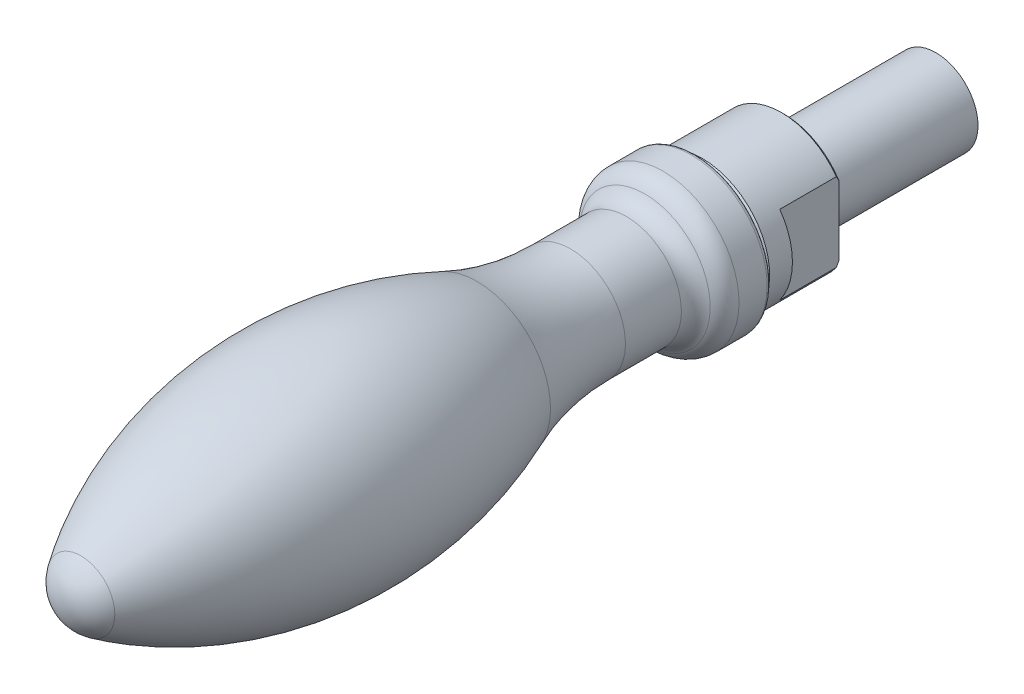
ISO-10303-21;
HEADER;
FILE_DESCRIPTION(('STEP AP214'),'2;1');
FILE_NAME('part.step','',(''),(''),'','','');
FILE_SCHEMA(('AUTOMOTIVE_DESIGN { 1 0 10303 214 1 1 1 1 }'));
ENDSEC;
DATA;
#1=APPLICATION_CONTEXT('core data for automotive mechanical design processes');
#2=APPLICATION_PROTOCOL_DEFINITION('international standard','automotive_design',2000,#1);
#3=PRODUCT_CONTEXT('',#1,'mechanical');
#4=PRODUCT('Part','Part','',(#3));
#5=PRODUCT_RELATED_PRODUCT_CATEGORY('part','',(#4));
#6=PRODUCT_DEFINITION_FORMATION('','',#4);
#7=PRODUCT_DEFINITION_CONTEXT('part definition',#1,'design');
#8=PRODUCT_DEFINITION('design','',#6,#7);
#9=PRODUCT_DEFINITION_SHAPE('','',#8);
#10=(LENGTH_UNIT() NAMED_UNIT(*) SI_UNIT(.MILLI.,.METRE.));
#11=(NAMED_UNIT(*) PLANE_ANGLE_UNIT() SI_UNIT($,.RADIAN.));
#12=(NAMED_UNIT(*) SI_UNIT($,.STERADIAN.) SOLID_ANGLE_UNIT());
#13=UNCERTAINTY_MEASURE_WITH_UNIT(LENGTH_MEASURE(1.E-05),#10,'distance_accuracy_value','');
#14=(GEOMETRIC_REPRESENTATION_CONTEXT(3) GLOBAL_UNCERTAINTY_ASSIGNED_CONTEXT((#13)) GLOBAL_UNIT_ASSIGNED_CONTEXT((#10,
#11,#12)) REPRESENTATION_CONTEXT('',''));
#15=CARTESIAN_POINT('',(0.,0.,0.));
#16=DIRECTION('',(0.,0.,1.));
#17=DIRECTION('',(1.,0.,0.));
#18=AXIS2_PLACEMENT_3D('',#15,#16,#17);
#19=CARTESIAN_POINT('',(0.,0.,-22.9999999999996));
#20=DIRECTION('',(0.,0.,-1.));
#21=DIRECTION('',(0.,1.,0.));
#22=AXIS2_PLACEMENT_3D('',#19,#20,#21);
#23=CYLINDRICAL_SURFACE('',#22,8.);
#24=CARTESIAN_POINT('',(0.,0.,9.7));
#25=DIRECTION('',(0.,0.,-1.));
#26=DIRECTION('',(0.,1.,0.));
#27=AXIS2_PLACEMENT_3D('',#24,#25,#26);
#28=CIRCLE('',#27,8.);
#29=CARTESIAN_POINT('',(0.,8.,9.7));
#30=VERTEX_POINT('',#29);
#31=EDGE_CURVE('E205',#30,#30,#28,.T.);
#32=ORIENTED_EDGE('',*,*,#31,.T.);
#33=EDGE_LOOP('',(#32));
#34=FACE_BOUND('',#33,.T.);
#35=CARTESIAN_POINT('',(0.,0.,0.299999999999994));
#36=DIRECTION('',(0.,0.,-1.));
#37=DIRECTION('',(0.,1.,0.));
#38=AXIS2_PLACEMENT_3D('',#35,#36,#37);
#39=CIRCLE('',#38,8.);
#40=CARTESIAN_POINT('',(-6.5,4.66368952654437,0.299999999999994));
#41=VERTEX_POINT('',#40);
#42=CARTESIAN_POINT('',(6.5,4.66368952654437,0.299999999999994));
#43=VERTEX_POINT('',#42);
#44=EDGE_CURVE('E84',#41,#43,#39,.T.);
#45=ORIENTED_EDGE('',*,*,#44,.F.);
#46=DIRECTION('',(0.,0.,-1.));
#47=VECTOR('',#46,1.);
#48=CARTESIAN_POINT('',(-6.5,4.66368952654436,-22.9999999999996));
#49=LINE('',#48,#47);
#50=CARTESIAN_POINT('',(-6.5,4.66368952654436,6.99999999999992));
#51=VERTEX_POINT('',#50);
#52=EDGE_CURVE('E77',#41,#51,#49,.F.);
#53=ORIENTED_EDGE('',*,*,#52,.T.);
#54=CARTESIAN_POINT('',(0.,0.,6.99999999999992));
#55=DIRECTION('',(0.,0.,1.));
#56=DIRECTION('',(0.,-1.,0.));
#57=AXIS2_PLACEMENT_3D('',#54,#55,#56);
#58=CIRCLE('',#57,8.);
#59=CARTESIAN_POINT('',(-6.5,-4.66368952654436,6.99999999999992));
#60=VERTEX_POINT('',#59);
#61=EDGE_CURVE('E9',#60,#51,#58,.F.);
#62=ORIENTED_EDGE('',*,*,#61,.F.);
#63=DIRECTION('',(0.,0.,-1.));
#64=VECTOR('',#63,1.);
#65=CARTESIAN_POINT('',(-6.5,-4.66368952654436,-22.9999999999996));
#66=LINE('',#65,#64);
#67=CARTESIAN_POINT('',(-6.5,-4.66368952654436,0.299999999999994));
#68=VERTEX_POINT('',#67);
#69=EDGE_CURVE('E66',#60,#68,#66,.T.);
#70=ORIENTED_EDGE('',*,*,#69,.T.);
#71=CARTESIAN_POINT('',(6.5,-4.66368952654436,0.299999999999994));
#72=VERTEX_POINT('',#71);
#73=EDGE_CURVE('E223',#72,#68,#39,.T.);
#74=ORIENTED_EDGE('',*,*,#73,.F.);
#75=DIRECTION('',(0.,0.,-1.));
#76=VECTOR('',#75,1.);
#77=CARTESIAN_POINT('',(6.5,-4.66368952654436,-22.9999999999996));
#78=LINE('',#77,#76);
#79=CARTESIAN_POINT('',(6.5,-4.66368952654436,6.99999999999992));
#80=VERTEX_POINT('',#79);
#81=EDGE_CURVE('E230',#80,#72,#78,.T.);
#82=ORIENTED_EDGE('',*,*,#81,.F.);
#83=CARTESIAN_POINT('',(0.,0.,6.99999999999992));
#84=DIRECTION('',(0.,0.,-1.));
#85=DIRECTION('',(0.,1.,0.));
#86=AXIS2_PLACEMENT_3D('',#83,#84,#85);
#87=CIRCLE('',#86,8.);
#88=CARTESIAN_POINT('',(6.5,4.66368952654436,6.99999999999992));
#89=VERTEX_POINT('',#88);
#90=EDGE_CURVE('E203',#80,#89,#87,.F.);
#91=ORIENTED_EDGE('',*,*,#90,.T.);
#92=DIRECTION('',(0.,0.,-1.));
#93=VECTOR('',#92,1.);
#94=CARTESIAN_POINT('',(6.5,4.66368952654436,-22.9999999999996));
#95=LINE('',#94,#93);
#96=EDGE_CURVE('E227',#43,#89,#95,.F.);
#97=ORIENTED_EDGE('',*,*,#96,.F.);
#98=EDGE_LOOP('',(#45,#53,#62,#70,#74,#82,#91,#97));
#99=FACE_BOUND('',#98,.T.);
#100=ADVANCED_FACE('F14',(#34,#99),#23,.T.);
#101=CARTESIAN_POINT('',(0.,0.,0.));
#102=DIRECTION('',(0.,0.,1.));
#103=DIRECTION('',(0.,-1.,0.));
#104=AXIS2_PLACEMENT_3D('',#101,#102,#103);
#105=CONICAL_SURFACE('',#104,7.7,0.785398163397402);
#106=ORIENTED_EDGE('',*,*,#73,.T.);
#107=CARTESIAN_POINT('',(-6.5,-10.7476397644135,4.86032485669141));
#108=CARTESIAN_POINT('',(-6.5,-10.4743236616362,4.62651096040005));
#109=CARTESIAN_POINT('',(-6.5,-10.1998725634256,4.3940042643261));
#110=CARTESIAN_POINT('',(-6.5,-9.64805570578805,3.93235778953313));
#111=CARTESIAN_POINT('',(-6.5,-9.3706893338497,3.70321874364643));
#112=CARTESIAN_POINT('',(-6.5,-8.81068016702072,3.24766930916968));
#113=CARTESIAN_POINT('',(-6.5,-8.52801467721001,3.02128674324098));
#114=CARTESIAN_POINT('',(-6.5,-7.95840712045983,2.57400091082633));
#115=CARTESIAN_POINT('',(-6.5,-7.67146542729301,2.35309716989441));
#116=CARTESIAN_POINT('',(-6.5,-7.10387135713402,1.9271091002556));
#117=CARTESIAN_POINT('',(-6.5,-6.82342914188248,1.72174573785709));
#118=CARTESIAN_POINT('',(-6.5,-6.25637524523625,1.31954713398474));
#119=CARTESIAN_POINT('',(-6.5,-5.96976238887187,1.12271353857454));
#120=CARTESIAN_POINT('',(-6.5,-5.38951207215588,0.740922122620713));
#121=CARTESIAN_POINT('',(-6.5,-5.09588979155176,0.555941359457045));
#122=CARTESIAN_POINT('',(-6.5,-4.4993473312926,0.201675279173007));
#123=CARTESIAN_POINT('',(-6.5,-4.19643168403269,0.0323824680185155));
#124=CARTESIAN_POINT('',(-6.5,-3.75630978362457,-0.193523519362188));
#125=CARTESIAN_POINT('',(-6.5,-3.62368369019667,-0.259084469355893));
#126=CARTESIAN_POINT('',(-6.5,-3.35624398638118,-0.385598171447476));
#127=CARTESIAN_POINT('',(-6.5,-3.22143042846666,-0.446551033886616));
#128=CARTESIAN_POINT('',(-6.5,-2.94973823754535,-0.563059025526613));
#129=CARTESIAN_POINT('',(-6.5,-2.81286327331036,-0.618622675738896));
#130=CARTESIAN_POINT('',(-6.5,-2.53678404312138,-0.723684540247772));
#131=CARTESIAN_POINT('',(-6.5,-2.39757964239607,-0.773182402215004));
#132=CARTESIAN_POINT('',(-6.5,-2.11465531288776,-0.865994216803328));
#133=CARTESIAN_POINT('',(-6.5,-1.97089877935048,-0.909197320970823));
#134=CARTESIAN_POINT('',(-6.5,-1.68122524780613,-0.987543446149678));
#135=CARTESIAN_POINT('',(-6.5,-1.53530872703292,-1.02268822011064));
#136=CARTESIAN_POINT('',(-6.5,-1.24068347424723,-1.08422588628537));
#137=CARTESIAN_POINT('',(-6.5,-1.09196308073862,-1.11056354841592));
#138=CARTESIAN_POINT('',(-6.5,-0.792996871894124,-1.15349058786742));
#139=CARTESIAN_POINT('',(-6.5,-0.64274984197,-1.17007146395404));
#140=CARTESIAN_POINT('',(-6.5,-0.49206240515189,-1.18140157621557));
#141=B_SPLINE_CURVE_WITH_KNOTS('',3,(#107,#108,#109,#110,#111,#112,#113,#114,#115,#116,#117,
#118,#119,#120,#121,#122,#123,#124,#125,#126,#127,#128,#129,#130,#131,#132,#133,#134,#135,#136,
#137,#138,#139,#140),.UNSPECIFIED.,.F.,.F.,(4,2,2,2,2,2,2,2,2,2,2,2,2,2,2,2,4),(0.,
1.07905876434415,2.15834896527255,3.24473097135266,4.33101856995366,5.37368385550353,
6.4165494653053,7.45733137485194,8.49761351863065,8.94138053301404,9.38513691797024,
9.82817982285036,10.2712484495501,10.7213624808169,11.1713785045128,11.6241658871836,
12.077347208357),.UNSPECIFIED.);
#142=CARTESIAN_POINT('',(-6.5,-4.12795348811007,0.));
#143=VERTEX_POINT('',#142);
#144=EDGE_CURVE('E72',#68,#143,#141,.T.);
#145=ORIENTED_EDGE('',*,*,#144,.T.);
#146=CARTESIAN_POINT('',(0.,0.,0.));
#147=DIRECTION('',(0.,0.,-1.));
#148=DIRECTION('',(0.,1.,0.));
#149=AXIS2_PLACEMENT_3D('',#146,#147,#148);
#150=CIRCLE('',#149,7.7);
#151=CARTESIAN_POINT('',(6.5,-4.12795348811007,0.));
#152=VERTEX_POINT('',#151);
#153=EDGE_CURVE('E214',#152,#143,#150,.T.);
#154=ORIENTED_EDGE('',*,*,#153,.F.);
#155=CARTESIAN_POINT('',(6.5,-10.7476397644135,4.86032485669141));
#156=CARTESIAN_POINT('',(6.5,-10.4743236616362,4.62651096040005));
#157=CARTESIAN_POINT('',(6.5,-10.1998725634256,4.3940042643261));
#158=CARTESIAN_POINT('',(6.5,-9.64805570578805,3.93235778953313));
#159=CARTESIAN_POINT('',(6.5,-9.3706893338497,3.70321874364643));
#160=CARTESIAN_POINT('',(6.5,-8.81068016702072,3.24766930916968));
#161=CARTESIAN_POINT('',(6.5,-8.52801467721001,3.02128674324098));
#162=CARTESIAN_POINT('',(6.5,-7.95840712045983,2.57400091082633));
#163=CARTESIAN_POINT('',(6.5,-7.67146542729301,2.35309716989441));
#164=CARTESIAN_POINT('',(6.5,-7.10387135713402,1.9271091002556));
#165=CARTESIAN_POINT('',(6.5,-6.82342914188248,1.72174573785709));
#166=CARTESIAN_POINT('',(6.5,-6.25637524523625,1.31954713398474));
#167=CARTESIAN_POINT('',(6.5,-5.96976238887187,1.12271353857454));
#168=CARTESIAN_POINT('',(6.5,-5.38951207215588,0.740922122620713));
#169=CARTESIAN_POINT('',(6.5,-5.09588979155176,0.555941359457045));
#170=CARTESIAN_POINT('',(6.5,-4.4993473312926,0.201675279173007));
#171=CARTESIAN_POINT('',(6.5,-4.19643168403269,0.0323824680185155));
#172=CARTESIAN_POINT('',(6.5,-3.75630978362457,-0.193523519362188));
#173=CARTESIAN_POINT('',(6.5,-3.62368369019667,-0.259084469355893));
#174=CARTESIAN_POINT('',(6.5,-3.35624398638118,-0.385598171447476));
#175=CARTESIAN_POINT('',(6.5,-3.22143042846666,-0.446551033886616));
#176=CARTESIAN_POINT('',(6.5,-2.94973823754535,-0.563059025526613));
#177=CARTESIAN_POINT('',(6.5,-2.81286327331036,-0.618622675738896));
#178=CARTESIAN_POINT('',(6.5,-2.53678404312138,-0.723684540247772));
#179=CARTESIAN_POINT('',(6.5,-2.39757964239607,-0.773182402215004));
#180=CARTESIAN_POINT('',(6.5,-2.11465531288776,-0.865994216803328));
#181=CARTESIAN_POINT('',(6.5,-1.97089877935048,-0.909197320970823));
#182=CARTESIAN_POINT('',(6.5,-1.68122524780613,-0.987543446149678));
#183=CARTESIAN_POINT('',(6.5,-1.53530872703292,-1.02268822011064));
#184=CARTESIAN_POINT('',(6.5,-1.24068347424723,-1.08422588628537));
#185=CARTESIAN_POINT('',(6.5,-1.09196308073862,-1.11056354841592));
#186=CARTESIAN_POINT('',(6.5,-0.792996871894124,-1.15349058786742));
#187=CARTESIAN_POINT('',(6.5,-0.64274984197,-1.17007146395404));
#188=CARTESIAN_POINT('',(6.5,-0.49206240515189,-1.18140157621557));
#189=B_SPLINE_CURVE_WITH_KNOTS('',3,(#155,#156,#157,#158,#159,#160,#161,#162,#163,#164,#165,
#166,#167,#168,#169,#170,#171,#172,#173,#174,#175,#176,#177,#178,#179,#180,#181,#182,#183,#184,
#185,#186,#187,#188),.UNSPECIFIED.,.F.,.F.,(4,2,2,2,2,2,2,2,2,2,2,2,2,2,2,2,4),(0.,
1.07905876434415,2.15834896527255,3.24473097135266,4.33101856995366,5.37368385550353,
6.4165494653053,7.45733137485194,8.49761351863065,8.94138053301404,9.38513691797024,
9.82817982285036,10.2712484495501,10.7213624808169,11.1713785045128,11.6241658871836,
12.077347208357),.UNSPECIFIED.);
#190=EDGE_CURVE('E37',#72,#152,#189,.T.);
#191=ORIENTED_EDGE('',*,*,#190,.F.);
#192=EDGE_LOOP('',(#106,#145,#154,#191));
#193=FACE_BOUND('',#192,.T.);
#194=ADVANCED_FACE('F105',(#193),#105,.T.);
#195=CARTESIAN_POINT('',(-6.5,4.12795348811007,0.));
#196=VERTEX_POINT('',#195);
#197=CARTESIAN_POINT('',(6.5,4.12795348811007,0.));
#198=VERTEX_POINT('',#197);
#199=EDGE_CURVE('E212',#196,#198,#150,.T.);
#200=ORIENTED_EDGE('',*,*,#199,.F.);
#201=CARTESIAN_POINT('',(-6.5,0.49206240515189,-1.18140157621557));
#202=CARTESIAN_POINT('',(-6.5,0.598815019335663,-1.17335248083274));
#203=CARTESIAN_POINT('',(-6.5,0.70534933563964,-1.16269300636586));
#204=CARTESIAN_POINT('',(-6.5,0.917769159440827,-1.1363713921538));
#205=CARTESIAN_POINT('',(-6.5,1.02365484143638,-1.12071066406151));
#206=CARTESIAN_POINT('',(-6.5,1.33963558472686,-1.06662581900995));
#207=CARTESIAN_POINT('',(-6.5,1.5485369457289,-1.02106079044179));
#208=CARTESIAN_POINT('',(-6.5,1.95949192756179,-0.913937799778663));
#209=CARTESIAN_POINT('',(-6.5,2.16159697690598,-0.852572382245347));
#210=CARTESIAN_POINT('',(-6.5,2.56117266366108,-0.716138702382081));
#211=CARTESIAN_POINT('',(-6.5,2.75864171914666,-0.641065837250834));
#212=CARTESIAN_POINT('',(-6.5,3.03296433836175,-0.527575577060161));
#213=CARTESIAN_POINT('',(-6.5,3.11180875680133,-0.493864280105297));
#214=CARTESIAN_POINT('',(-6.5,3.2687246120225,-0.424726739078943));
#215=CARTESIAN_POINT('',(-6.5,3.34679621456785,-0.389300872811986));
#216=CARTESIAN_POINT('',(-6.5,3.50246529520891,-0.316741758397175));
#217=CARTESIAN_POINT('',(-6.5,3.58006023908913,-0.279603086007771));
#218=CARTESIAN_POINT('',(-6.5,3.73452350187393,-0.203857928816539));
#219=CARTESIAN_POINT('',(-6.5,3.81139185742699,-0.165251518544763));
#220=CARTESIAN_POINT('',(-6.5,4.20752660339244,0.0380795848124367));
#221=CARTESIAN_POINT('',(-6.5,4.52114943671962,0.213870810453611));
#222=CARTESIAN_POINT('',(-6.5,5.13852557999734,0.582095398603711));
#223=CARTESIAN_POINT('',(-6.5,5.44227259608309,0.774539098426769));
#224=CARTESIAN_POINT('',(-6.5,6.04267183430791,1.17204409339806));
#225=CARTESIAN_POINT('',(-6.5,6.3392998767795,1.37714171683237));
#226=CARTESIAN_POINT('',(-6.5,6.92606288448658,1.79622225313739));
#227=CARTESIAN_POINT('',(-6.5,7.21619935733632,2.01020306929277));
#228=CARTESIAN_POINT('',(-6.5,7.78254923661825,2.43828361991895));
#229=CARTESIAN_POINT('',(-6.5,8.05891713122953,2.65217974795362));
#230=CARTESIAN_POINT('',(-6.5,8.60775789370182,3.08494532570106));
#231=CARTESIAN_POINT('',(-6.5,8.88023043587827,3.30381518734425));
#232=CARTESIAN_POINT('',(-6.5,9.42002769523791,3.74388953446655));
#233=CARTESIAN_POINT('',(-6.5,9.68737532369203,3.96506598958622));
#234=CARTESIAN_POINT('',(-6.5,10.2193812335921,4.41052982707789));
#235=CARTESIAN_POINT('',(-6.5,10.4840400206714,4.63481660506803));
#236=CARTESIAN_POINT('',(-6.5,10.7476397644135,4.86032485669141));
#237=B_SPLINE_CURVE_WITH_KNOTS('',3,(#201,#202,#203,#204,#205,#206,#207,#208,#209,#210,#211,
#212,#213,#214,#215,#216,#217,#218,#219,#220,#221,#222,#223,#224,#225,#226,#227,#228,#229,#230,
#231,#232,#233,#234,#235,#236),.UNSPECIFIED.,.F.,.F.,(4,2,2,2,2,2,2,2,2,2,2,2,2,2,2,2,2,4),(0.,
0.321097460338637,0.642104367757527,1.28267149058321,1.91577440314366,2.54909029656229,
2.80632462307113,3.0635025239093,3.32155985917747,3.57960410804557,4.65733378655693,
5.73573735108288,6.81739565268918,7.89880008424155,8.94714592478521,9.99557890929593,
11.0364871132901,12.0771958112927),.UNSPECIFIED.);
#238=EDGE_CURVE('E29',#196,#41,#237,.T.);
#239=ORIENTED_EDGE('',*,*,#238,.T.);
#240=ORIENTED_EDGE('',*,*,#44,.T.);
#241=CARTESIAN_POINT('',(6.5,0.49206240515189,-1.18140157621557));
#242=CARTESIAN_POINT('',(6.5,0.598815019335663,-1.17335248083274));
#243=CARTESIAN_POINT('',(6.5,0.70534933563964,-1.16269300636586));
#244=CARTESIAN_POINT('',(6.5,0.917769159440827,-1.1363713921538));
#245=CARTESIAN_POINT('',(6.5,1.02365484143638,-1.12071066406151));
#246=CARTESIAN_POINT('',(6.5,1.33963558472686,-1.06662581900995));
#247=CARTESIAN_POINT('',(6.5,1.5485369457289,-1.02106079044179));
#248=CARTESIAN_POINT('',(6.5,1.95949192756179,-0.913937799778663));
#249=CARTESIAN_POINT('',(6.5,2.16159697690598,-0.852572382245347));
#250=CARTESIAN_POINT('',(6.5,2.56117266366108,-0.716138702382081));
#251=CARTESIAN_POINT('',(6.5,2.75864171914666,-0.641065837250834));
#252=CARTESIAN_POINT('',(6.5,3.03296433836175,-0.527575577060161));
#253=CARTESIAN_POINT('',(6.5,3.11180875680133,-0.493864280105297));
#254=CARTESIAN_POINT('',(6.5,3.2687246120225,-0.424726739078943));
#255=CARTESIAN_POINT('',(6.5,3.34679621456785,-0.389300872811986));
#256=CARTESIAN_POINT('',(6.5,3.50246529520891,-0.316741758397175));
#257=CARTESIAN_POINT('',(6.5,3.58006023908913,-0.279603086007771));
#258=CARTESIAN_POINT('',(6.5,3.73452350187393,-0.203857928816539));
#259=CARTESIAN_POINT('',(6.5,3.81139185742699,-0.165251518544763));
#260=CARTESIAN_POINT('',(6.5,4.20752660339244,0.0380795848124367));
#261=CARTESIAN_POINT('',(6.5,4.52114943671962,0.213870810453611));
#262=CARTESIAN_POINT('',(6.5,5.13852557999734,0.582095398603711));
#263=CARTESIAN_POINT('',(6.5,5.44227259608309,0.774539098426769));
#264=CARTESIAN_POINT('',(6.5,6.04267183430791,1.17204409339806));
#265=CARTESIAN_POINT('',(6.5,6.3392998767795,1.37714171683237));
#266=CARTESIAN_POINT('',(6.5,6.92606288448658,1.79622225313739));
#267=CARTESIAN_POINT('',(6.5,7.21619935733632,2.01020306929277));
#268=CARTESIAN_POINT('',(6.5,7.78254923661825,2.43828361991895));
#269=CARTESIAN_POINT('',(6.5,8.05891713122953,2.65217974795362));
#270=CARTESIAN_POINT('',(6.5,8.60775789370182,3.08494532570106));
#271=CARTESIAN_POINT('',(6.5,8.88023043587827,3.30381518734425));
#272=CARTESIAN_POINT('',(6.5,9.42002769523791,3.74388953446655));
#273=CARTESIAN_POINT('',(6.5,9.68737532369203,3.96506598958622));
#274=CARTESIAN_POINT('',(6.5,10.2193812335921,4.41052982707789));
#275=CARTESIAN_POINT('',(6.5,10.4840400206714,4.63481660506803));
#276=CARTESIAN_POINT('',(6.5,10.7476397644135,4.86032485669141));
#277=B_SPLINE_CURVE_WITH_KNOTS('',3,(#241,#242,#243,#244,#245,#246,#247,#248,#249,#250,#251,
#252,#253,#254,#255,#256,#257,#258,#259,#260,#261,#262,#263,#264,#265,#266,#267,#268,#269,#270,
#271,#272,#273,#274,#275,#276),.UNSPECIFIED.,.F.,.F.,(4,2,2,2,2,2,2,2,2,2,2,2,2,2,2,2,2,4),(0.,
0.321097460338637,0.642104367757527,1.28267149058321,1.91577440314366,2.54909029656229,
2.80632462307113,3.0635025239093,3.32155985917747,3.57960410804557,4.65733378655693,
5.73573735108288,6.81739565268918,7.89880008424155,8.94714592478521,9.99557890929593,
11.0364871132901,12.0771958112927),.UNSPECIFIED.);
#278=EDGE_CURVE('E88',#198,#43,#277,.T.);
#279=ORIENTED_EDGE('',*,*,#278,.F.);
#280=EDGE_LOOP('',(#200,#239,#240,#279));
#281=FACE_BOUND('',#280,.T.);
#282=ADVANCED_FACE('F167',(#281),#105,.T.);
#283=CARTESIAN_POINT('',(5.,0.,0.));
#284=DIRECTION('',(0.,0.,-1.));
#285=DIRECTION('',(0.,1.,0.));
#286=AXIS2_PLACEMENT_3D('',#283,#284,#285);
#287=PLANE('',#286);
#288=CARTESIAN_POINT('',(0.,0.,0.));
#289=DIRECTION('',(0.,0.,-1.));
#290=DIRECTION('',(0.,1.,0.));
#291=AXIS2_PLACEMENT_3D('',#288,#289,#290);
#292=CIRCLE('',#291,5.);
#293=CARTESIAN_POINT('',(0.,5.,0.));
#294=VERTEX_POINT('',#293);
#295=EDGE_CURVE('E216',#294,#294,#292,.T.);
#296=ORIENTED_EDGE('',*,*,#295,.F.);
#297=EDGE_LOOP('',(#296));
#298=FACE_BOUND('',#297,.T.);
#299=ORIENTED_EDGE('',*,*,#153,.T.);
#300=DIRECTION('',(0.,1.,0.));
#301=VECTOR('',#300,1.);
#302=CARTESIAN_POINT('',(-6.5,0.,0.));
#303=LINE('',#302,#301);
#304=EDGE_CURVE('E22',#143,#196,#303,.T.);
#305=ORIENTED_EDGE('',*,*,#304,.T.);
#306=ORIENTED_EDGE('',*,*,#199,.T.);
#307=DIRECTION('',(0.,1.,0.));
#308=VECTOR('',#307,1.);
#309=CARTESIAN_POINT('',(6.5,0.,0.));
#310=LINE('',#309,#308);
#311=EDGE_CURVE('E201',#152,#198,#310,.T.);
#312=ORIENTED_EDGE('',*,*,#311,.F.);
#313=EDGE_LOOP('',(#299,#305,#306,#312));
#314=FACE_BOUND('',#313,.T.);
#315=ADVANCED_FACE('F165',(#298,#314),#287,.T.);
#316=CARTESIAN_POINT('',(0.,0.,10.4));
#317=DIRECTION('',(0.,0.,-1.));
#318=DIRECTION('',(0.,1.,0.));
#319=AXIS2_PLACEMENT_3D('',#316,#317,#318);
#320=TOROIDAL_SURFACE('',#319,3.65,0.400000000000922);
#321=CARTESIAN_POINT('',(0.,0.,10.5));
#322=DIRECTION('',(0.,0.,-1.));
#323=DIRECTION('',(0.,1.,0.));
#324=AXIS2_PLACEMENT_3D('',#321,#322,#323);
#325=CIRCLE('',#324,3.26270166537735);
#326=CARTESIAN_POINT('',(0.,3.26270166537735,10.5));
#327=VERTEX_POINT('',#326);
#328=EDGE_CURVE('E229',#327,#327,#325,.T.);
#329=ORIENTED_EDGE('',*,*,#328,.T.);
#330=EDGE_LOOP('',(#329));
#331=FACE_BOUND('',#330,.T.);
#332=CARTESIAN_POINT('',(0.,0.,10.));
#333=DIRECTION('',(0.,0.,-1.));
#334=DIRECTION('',(0.,1.,0.));
#335=AXIS2_PLACEMENT_3D('',#332,#333,#334);
#336=CIRCLE('',#335,3.65);
#337=CARTESIAN_POINT('',(0.,3.65,10.));
#338=VERTEX_POINT('',#337);
#339=EDGE_CURVE('E199',#338,#338,#336,.T.);
#340=ORIENTED_EDGE('',*,*,#339,.F.);
#341=EDGE_LOOP('',(#340));
#342=FACE_BOUND('',#341,.T.);
#343=ADVANCED_FACE('F16',(#331,#342),#320,.F.);
#344=CARTESIAN_POINT('',(3.65,0.,10.));
#345=DIRECTION('',(0.,0.,-1.));
#346=DIRECTION('',(0.,1.,0.));
#347=AXIS2_PLACEMENT_3D('',#344,#345,#346);
#348=PLANE('',#347);
#349=CARTESIAN_POINT('',(0.,0.,10.));
#350=DIRECTION('',(0.,0.,-1.));
#351=DIRECTION('',(0.,1.,0.));
#352=AXIS2_PLACEMENT_3D('',#349,#350,#351);
#353=CIRCLE('',#352,7.7);
#354=CARTESIAN_POINT('',(0.,7.7,10.));
#355=VERTEX_POINT('',#354);
#356=EDGE_CURVE('E196',#355,#355,#353,.T.);
#357=ORIENTED_EDGE('',*,*,#356,.F.);
#358=EDGE_LOOP('',(#357));
#359=FACE_BOUND('',#358,.T.);
#360=ORIENTED_EDGE('',*,*,#339,.T.);
#361=EDGE_LOOP('',(#360));
#362=FACE_BOUND('',#361,.T.);
#363=ADVANCED_FACE('F174',(#359,#362),#348,.F.);
#364=CARTESIAN_POINT('',(0.,0.,9.7));
#365=DIRECTION('',(0.,0.,-1.));
#366=DIRECTION('',(0.,1.,0.));
#367=AXIS2_PLACEMENT_3D('',#364,#365,#366);
#368=CONICAL_SURFACE('',#367,8.,0.785398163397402);
#369=ORIENTED_EDGE('',*,*,#356,.T.);
#370=EDGE_LOOP('',(#369));
#371=FACE_BOUND('',#370,.T.);
#372=ORIENTED_EDGE('',*,*,#31,.F.);
#373=EDGE_LOOP('',(#372));
#374=FACE_BOUND('',#373,.T.);
#375=ADVANCED_FACE('F163',(#371,#374),#368,.T.);
#376=CARTESIAN_POINT('',(0.,0.,-22.9999999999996));
#377=DIRECTION('',(0.,0.,-1.));
#378=DIRECTION('',(0.,1.,0.));
#379=AXIS2_PLACEMENT_3D('',#376,#377,#378);
#380=CYLINDRICAL_SURFACE('',#379,5.);
#381=ORIENTED_EDGE('',*,*,#295,.T.);
#382=EDGE_LOOP('',(#381));
#383=FACE_BOUND('',#382,.T.);
#384=CARTESIAN_POINT('',(0.,0.,-18.));
#385=DIRECTION('',(0.,0.,-1.));
#386=DIRECTION('',(0.,1.,0.));
#387=AXIS2_PLACEMENT_3D('',#384,#385,#386);
#388=CIRCLE('',#387,5.);
#389=CARTESIAN_POINT('',(0.,5.,-18.));
#390=VERTEX_POINT('',#389);
#391=EDGE_CURVE('E219',#390,#390,#388,.T.);
#392=ORIENTED_EDGE('',*,*,#391,.F.);
#393=EDGE_LOOP('',(#392));
#394=FACE_BOUND('',#393,.T.);
#395=ADVANCED_FACE('F160',(#383,#394),#380,.T.);
#396=CARTESIAN_POINT('',(0.,0.,-18.));
#397=DIRECTION('',(0.,0.,-1.));
#398=DIRECTION('',(0.,1.,0.));
#399=AXIS2_PLACEMENT_3D('',#396,#397,#398);
#400=PLANE('',#399);
#401=ORIENTED_EDGE('',*,*,#391,.T.);
#402=EDGE_LOOP('',(#401));
#403=FACE_BOUND('',#402,.T.);
#404=ADVANCED_FACE('F156',(#403),#400,.T.);
#405=CARTESIAN_POINT('',(0.,0.,80.65625));
#406=DIRECTION('',(0.,1.,0.));
#407=DIRECTION('',(0.,0.,1.));
#408=AXIS2_PLACEMENT_3D('',#405,#406,#407);
#409=SPHERICAL_SURFACE('',#408,4.84375);
#410=CARTESIAN_POINT('',(0.,0.,80.65625));
#411=DIRECTION('',(0.,0.,-1.));
#412=DIRECTION('',(0.,1.,0.));
#413=AXIS2_PLACEMENT_3D('',#410,#411,#412);
#414=SPHERICAL_SURFACE('',#413,4.84375);
#415=CARTESIAN_POINT('',(0.,0.,83.3546710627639));
#416=DIRECTION('',(0.,0.,-1.));
#417=DIRECTION('',(0.,1.,0.));
#418=AXIS2_PLACEMENT_3D('',#415,#416,#417);
#419=CIRCLE('',#418,4.02249149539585);
#420=CARTESIAN_POINT('',(0.,4.02249149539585,83.3546710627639));
#421=VERTEX_POINT('',#420);
#422=EDGE_CURVE('E256',#421,#421,#419,.T.);
#423=ORIENTED_EDGE('',*,*,#422,.F.);
#424=EDGE_LOOP('',(#423));
#425=FACE_BOUND('',#424,.T.);
#426=ADVANCED_FACE('F152',(#425),#414,.T.);
#427=CARTESIAN_POINT('',(0.,0.,55.5));
#428=DIRECTION('',(0.,0.,-1.));
#429=DIRECTION('',(0.,1.,0.));
#430=AXIS2_PLACEMENT_3D('',#427,#428,#429);
#431=DEGENERATE_TOROIDAL_SURFACE('',#430,37.5,50.,.F.);
#432=CARTESIAN_POINT('',(0.,0.,36.3864956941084));
#433=DIRECTION('',(0.,0.,-1.));
#434=DIRECTION('',(0.,1.,0.));
#435=AXIS2_PLACEMENT_3D('',#432,#433,#434);
#436=CIRCLE('',#435,8.70253189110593);
#437=CARTESIAN_POINT('',(0.,8.70253189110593,36.3864956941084));
#438=VERTEX_POINT('',#437);
#439=EDGE_CURVE('E253',#438,#438,#436,.T.);
#440=ORIENTED_EDGE('',*,*,#439,.F.);
#441=EDGE_LOOP('',(#440));
#442=FACE_BOUND('',#441,.T.);
#443=ORIENTED_EDGE('',*,*,#422,.T.);
#444=EDGE_LOOP('',(#443));
#445=FACE_BOUND('',#444,.T.);
#446=ADVANCED_FACE('F148',(#442,#445),#431,.F.);
#447=CARTESIAN_POINT('',(0.,0.,25.3006622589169));
#448=DIRECTION('',(0.,0.,-1.));
#449=DIRECTION('',(0.,1.,0.));
#450=AXIS2_PLACEMENT_3D('',#447,#448,#449);
#451=TOROIDAL_SURFACE('',#450,35.5,29.);
#452=ORIENTED_EDGE('',*,*,#439,.T.);
#453=EDGE_LOOP('',(#452));
#454=FACE_BOUND('',#453,.T.);
#455=CARTESIAN_POINT('',(0.,0.,25.3006622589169));
#456=DIRECTION('',(0.,0.,-1.));
#457=DIRECTION('',(0.,1.,0.));
#458=AXIS2_PLACEMENT_3D('',#455,#456,#457);
#459=CIRCLE('',#458,6.5);
#460=CARTESIAN_POINT('',(0.,6.5,25.3006622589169));
#461=VERTEX_POINT('',#460);
#462=EDGE_CURVE('E250',#461,#461,#459,.T.);
#463=ORIENTED_EDGE('',*,*,#462,.F.);
#464=EDGE_LOOP('',(#463));
#465=FACE_BOUND('',#464,.T.);
#466=ADVANCED_FACE('F144',(#454,#465),#451,.F.);
#467=CARTESIAN_POINT('',(0.,0.,-22.9999999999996));
#468=DIRECTION('',(0.,0.,-1.));
#469=DIRECTION('',(0.,1.,0.));
#470=AXIS2_PLACEMENT_3D('',#467,#468,#469);
#471=CYLINDRICAL_SURFACE('',#470,6.4999999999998);
#472=ORIENTED_EDGE('',*,*,#462,.T.);
#473=EDGE_LOOP('',(#472));
#474=FACE_BOUND('',#473,.T.);
#475=CARTESIAN_POINT('',(0.,0.,18.6650635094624));
#476=DIRECTION('',(0.,0.,-1.));
#477=DIRECTION('',(0.,1.,0.));
#478=AXIS2_PLACEMENT_3D('',#475,#476,#477);
#479=CIRCLE('',#478,6.49999999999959);
#480=CARTESIAN_POINT('',(0.,6.49999999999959,18.6650635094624));
#481=VERTEX_POINT('',#480);
#482=EDGE_CURVE('E247',#481,#481,#479,.T.);
#483=ORIENTED_EDGE('',*,*,#482,.F.);
#484=EDGE_LOOP('',(#483));
#485=FACE_BOUND('',#484,.T.);
#486=ADVANCED_FACE('F140',(#474,#485),#471,.T.);
#487=CARTESIAN_POINT('',(0.,0.,18.6650635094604));
#488=DIRECTION('',(0.,0.,-1.));
#489=DIRECTION('',(0.,1.,0.));
#490=AXIS2_PLACEMENT_3D('',#487,#488,#489);
#491=TOROIDAL_SURFACE('',#490,9.,2.50000000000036);
#492=ORIENTED_EDGE('',*,*,#482,.T.);
#493=EDGE_LOOP('',(#492));
#494=FACE_BOUND('',#493,.T.);
#495=CARTESIAN_POINT('',(0.,0.,16.4999999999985));
#496=DIRECTION('',(0.,0.,-1.));
#497=DIRECTION('',(0.,1.,0.));
#498=AXIS2_PLACEMENT_3D('',#495,#496,#497);
#499=CIRCLE('',#498,7.75);
#500=CARTESIAN_POINT('',(0.,7.75,16.4999999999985));
#501=VERTEX_POINT('',#500);
#502=EDGE_CURVE('E244',#501,#501,#499,.T.);
#503=ORIENTED_EDGE('',*,*,#502,.F.);
#504=EDGE_LOOP('',(#503));
#505=FACE_BOUND('',#504,.T.);
#506=ADVANCED_FACE('F136',(#494,#505),#491,.F.);
#507=CARTESIAN_POINT('',(0.,0.,14.3349364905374));
#508=DIRECTION('',(0.,0.,-1.));
#509=DIRECTION('',(0.,1.,0.));
#510=AXIS2_PLACEMENT_3D('',#507,#508,#509);
#511=TOROIDAL_SURFACE('',#510,6.5,2.5);
#512=CARTESIAN_POINT('',(0.,0.,14.3349364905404));
#513=DIRECTION('',(0.,0.,-1.));
#514=DIRECTION('',(0.,1.,0.));
#515=AXIS2_PLACEMENT_3D('',#512,#513,#514);
#516=CIRCLE('',#515,9.);
#517=CARTESIAN_POINT('',(0.,9.,14.3349364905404));
#518=VERTEX_POINT('',#517);
#519=EDGE_CURVE('E241',#518,#518,#516,.T.);
#520=ORIENTED_EDGE('',*,*,#519,.F.);
#521=EDGE_LOOP('',(#520));
#522=FACE_BOUND('',#521,.T.);
#523=ORIENTED_EDGE('',*,*,#502,.T.);
#524=EDGE_LOOP('',(#523));
#525=FACE_BOUND('',#524,.T.);
#526=ADVANCED_FACE('F132',(#522,#525),#511,.T.);
#527=CARTESIAN_POINT('',(0.,0.,-22.9999999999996));
#528=DIRECTION('',(0.,0.,-1.));
#529=DIRECTION('',(0.,1.,0.));
#530=AXIS2_PLACEMENT_3D('',#527,#528,#529);
#531=CYLINDRICAL_SURFACE('',#530,9.);
#532=ORIENTED_EDGE('',*,*,#519,.T.);
#533=EDGE_LOOP('',(#532));
#534=FACE_BOUND('',#533,.T.);
#535=CARTESIAN_POINT('',(0.,0.,11.));
#536=DIRECTION('',(0.,0.,-1.));
#537=DIRECTION('',(0.,1.,0.));
#538=AXIS2_PLACEMENT_3D('',#535,#536,#537);
#539=CIRCLE('',#538,9.);
#540=CARTESIAN_POINT('',(0.,9.,11.));
#541=VERTEX_POINT('',#540);
#542=EDGE_CURVE('E238',#541,#541,#539,.T.);
#543=ORIENTED_EDGE('',*,*,#542,.F.);
#544=EDGE_LOOP('',(#543));
#545=FACE_BOUND('',#544,.T.);
#546=ADVANCED_FACE('F128',(#534,#545),#531,.T.);
#547=CARTESIAN_POINT('',(0.,0.,11.));
#548=DIRECTION('',(0.,0.,-1.));
#549=DIRECTION('',(0.,1.,0.));
#550=AXIS2_PLACEMENT_3D('',#547,#548,#549);
#551=TOROIDAL_SURFACE('',#550,8.5,0.5);
#552=CARTESIAN_POINT('',(0.,0.,10.5));
#553=DIRECTION('',(0.,0.,-1.));
#554=DIRECTION('',(0.,1.,0.));
#555=AXIS2_PLACEMENT_3D('',#552,#553,#554);
#556=CIRCLE('',#555,8.5);
#557=CARTESIAN_POINT('',(0.,8.5,10.5));
#558=VERTEX_POINT('',#557);
#559=EDGE_CURVE('E233',#558,#558,#556,.T.);
#560=ORIENTED_EDGE('',*,*,#559,.F.);
#561=EDGE_LOOP('',(#560));
#562=FACE_BOUND('',#561,.T.);
#563=ORIENTED_EDGE('',*,*,#542,.T.);
#564=EDGE_LOOP('',(#563));
#565=FACE_BOUND('',#564,.T.);
#566=ADVANCED_FACE('F124',(#562,#565),#551,.T.);
#567=CARTESIAN_POINT('',(8.5,0.,10.5));
#568=DIRECTION('',(0.,0.,1.));
#569=DIRECTION('',(0.,-1.,0.));
#570=AXIS2_PLACEMENT_3D('',#567,#568,#569);
#571=PLANE('',#570);
#572=ORIENTED_EDGE('',*,*,#328,.F.);
#573=EDGE_LOOP('',(#572));
#574=FACE_BOUND('',#573,.T.);
#575=ORIENTED_EDGE('',*,*,#559,.T.);
#576=EDGE_LOOP('',(#575));
#577=FACE_BOUND('',#576,.T.);
#578=ADVANCED_FACE('F120',(#574,#577),#571,.F.);
#579=CARTESIAN_POINT('',(10.6515218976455,-5.,6.99999999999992));
#580=DIRECTION('',(0.,0.,-1.));
#581=DIRECTION('',(0.,1.,0.));
#582=AXIS2_PLACEMENT_3D('',#579,#580,#581);
#583=PLANE('',#582);
#584=DIRECTION('',(0.,1.,0.));
#585=VECTOR('',#584,1.);
#586=CARTESIAN_POINT('',(6.5,-5.,6.99999999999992));
#587=LINE('',#586,#585);
#588=EDGE_CURVE('E85',#80,#89,#587,.T.);
#589=ORIENTED_EDGE('',*,*,#588,.T.);
#590=ORIENTED_EDGE('',*,*,#90,.F.);
#591=EDGE_LOOP('',(#589,#590));
#592=FACE_BOUND('',#591,.T.);
#593=ADVANCED_FACE('F114',(#592),#583,.T.);
#594=CARTESIAN_POINT('',(6.5,-5.,-3.48996263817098));
#595=DIRECTION('',(-1.,0.,0.));
#596=DIRECTION('',(0.,-1.,0.));
#597=AXIS2_PLACEMENT_3D('',#594,#595,#596);
#598=PLANE('',#597);
#599=ORIENTED_EDGE('',*,*,#96,.T.);
#600=ORIENTED_EDGE('',*,*,#588,.F.);
#601=ORIENTED_EDGE('',*,*,#81,.T.);
#602=ORIENTED_EDGE('',*,*,#190,.T.);
#603=ORIENTED_EDGE('',*,*,#311,.T.);
#604=ORIENTED_EDGE('',*,*,#278,.T.);
#605=EDGE_LOOP('',(#599,#600,#601,#602,#603,#604));
#606=FACE_BOUND('',#605,.T.);
#607=ADVANCED_FACE('F109',(#606),#598,.F.);
#608=CARTESIAN_POINT('',(-6.5,-5.,-3.48996263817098));
#609=DIRECTION('',(-1.,0.,0.));
#610=DIRECTION('',(0.,-1.,0.));
#611=AXIS2_PLACEMENT_3D('',#608,#609,#610);
#612=PLANE('',#611);
#613=ORIENTED_EDGE('',*,*,#238,.F.);
#614=ORIENTED_EDGE('',*,*,#304,.F.);
#615=ORIENTED_EDGE('',*,*,#144,.F.);
#616=ORIENTED_EDGE('',*,*,#69,.F.);
#617=DIRECTION('',(0.,1.,0.));
#618=VECTOR('',#617,1.);
#619=CARTESIAN_POINT('',(-6.5,-5.,6.99999999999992));
#620=LINE('',#619,#618);
#621=EDGE_CURVE('E69',#60,#51,#620,.T.);
#622=ORIENTED_EDGE('',*,*,#621,.T.);
#623=ORIENTED_EDGE('',*,*,#52,.F.);
#624=EDGE_LOOP('',(#613,#614,#615,#616,#622,#623));
#625=FACE_BOUND('',#624,.T.);
#626=ADVANCED_FACE('F68',(#625),#612,.T.);
#627=CARTESIAN_POINT('',(-10.6515218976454,-5.,6.99999999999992));
#628=DIRECTION('',(0.,0.,1.));
#629=DIRECTION('',(0.,-1.,0.));
#630=AXIS2_PLACEMENT_3D('',#627,#628,#629);
#631=PLANE('',#630);
#632=ORIENTED_EDGE('',*,*,#61,.T.);
#633=ORIENTED_EDGE('',*,*,#621,.F.);
#634=EDGE_LOOP('',(#632,#633));
#635=FACE_BOUND('',#634,.T.);
#636=ADVANCED_FACE('F80',(#635),#631,.F.);
#637=CLOSED_SHELL('',(#100,#194,#282,#315,#343,#363,#375,#395,#404,#426,#446,#466,#486,#506,
#526,#546,#566,#578,#593,#607,#626,#636));
#638=MANIFOLD_SOLID_BREP('B1',#637);
#639=ADVANCED_BREP_SHAPE_REPRESENTATION('',(#18,#638),#14);
#640=SHAPE_DEFINITION_REPRESENTATION(#9,#639);
ENDSEC;
END-ISO-10303-21;
